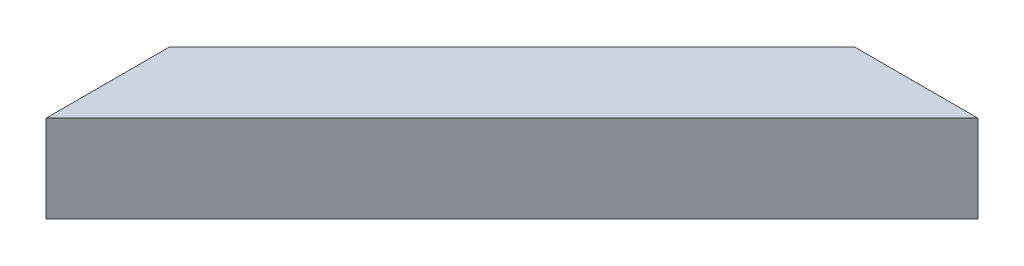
from build123d import *

# Parameters (mm, degrees)
EXTRUDE_1_DEPTH = 60


with BuildPart() as part:
    # Sketch 1 → Extrude 1 (new body)
    with BuildSketch(Plane(origin=(0, 0, 0), x_dir=(1, 0, 0), z_dir=(0, 1, 0))):
        Polygon((-160, -75.147186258), (-160, -160), (0, 0), (-42.426406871, 42.426406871), align=None)
        Polygon((-42.426406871, 42.426406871), (0, 0), (160, 160), (75.147186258, 160), align=None)
    extrude(amount=EXTRUDE_1_DEPTH)


solid = part.part
